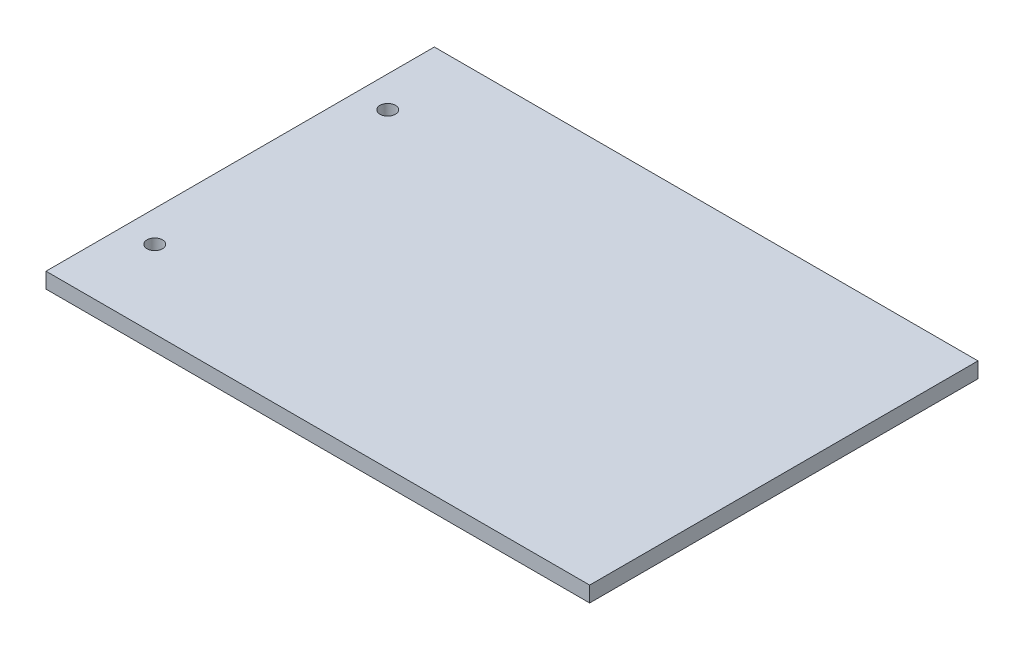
from build123d import *

# Parameters (mm, degrees)
SKETCH1_W           = 70
SKETCH1_H           = 50
SKETCH1_R           = 1
BOSS_EXTRUDE1_DEPTH = 2


with BuildPart() as part:
    # Sketch1 → Boss-Extrude1 (new body)
    with BuildSketch(Plane(origin=(0, 0, 0), x_dir=(1, 0, 0), z_dir=(0, 1, 0))):
        Rectangle(SKETCH1_W, SKETCH1_H)
        with Locations(Location((-31, 15, 0), (0, 0, 270))):
            Circle(SKETCH1_R, mode=Mode.SUBTRACT)
        with Locations(Location((-31, -15, 0), (0, 0, 270))):
            Circle(SKETCH1_R, mode=Mode.SUBTRACT)
    extrude(amount=BOSS_EXTRUDE1_DEPTH)


solid = part.part
